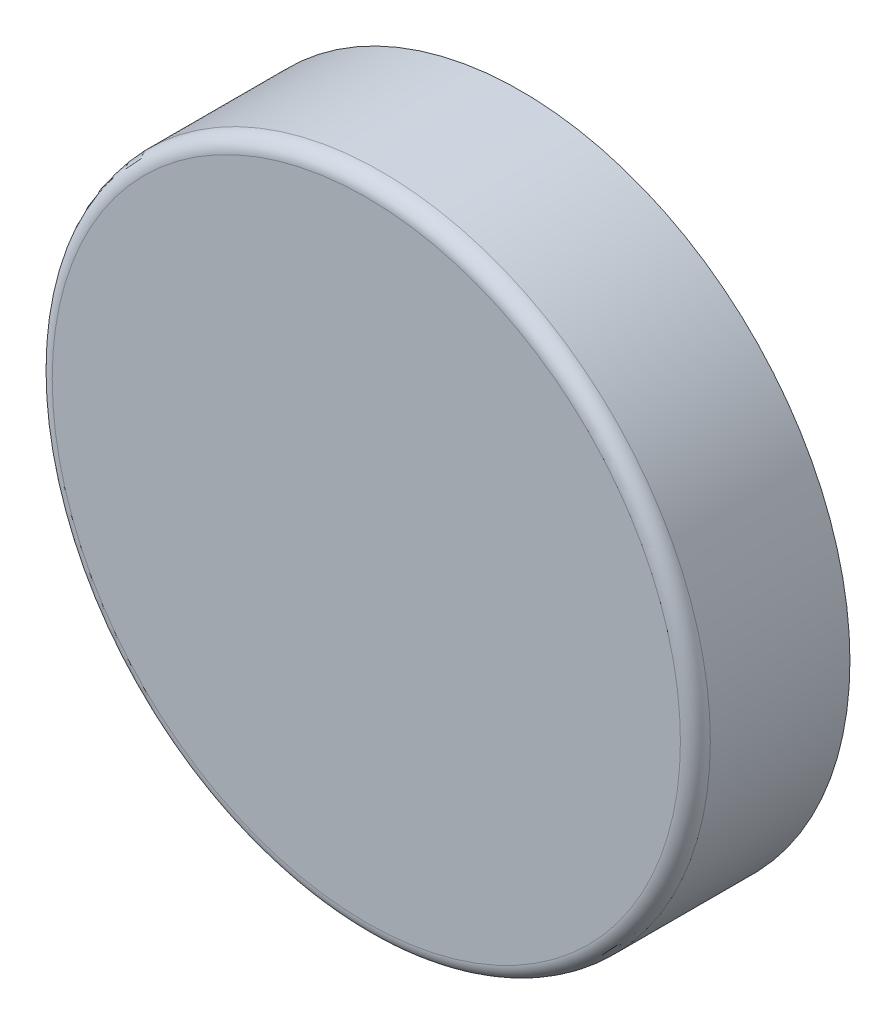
from build123d import *

# Parameters (mm, degrees)
ESQUISSE1_R             = 6.6
BOSS_EXTRU_1_DEPTH      = 3.1
ESQUISSE2_R             = 5.95
ENL_V_MAT_EXTRU_1_DEPTH = 2.04
CONG_1_R                = 0.3


with BuildPart() as part:
    # Esquisse1 → Boss.-Extru.1 (new body)
    with BuildSketch(Plane.XY):
        with Locations(Location((0, 0, 0), (0, 0, 180))):
            Circle(ESQUISSE1_R)
    extrude(amount=BOSS_EXTRU_1_DEPTH)

    # Esquisse2 → Enl_v. mat.-Extru.1 (cut)
    with BuildSketch(Plane(origin=(0, 0, 0), x_dir=(-1, 0, 0), z_dir=(0, 0, -1))):
        Circle(ESQUISSE2_R)
    extrude(amount=-ENL_V_MAT_EXTRU_1_DEPTH, mode=Mode.SUBTRACT)

    # Cong_1
    cong_1_edges = [part.edges().sort_by_distance(p)[0] for p in [
        (6.6, 0, 3.1),
    ]]
    fillet(cong_1_edges, radius=CONG_1_R)


solid = part.part
